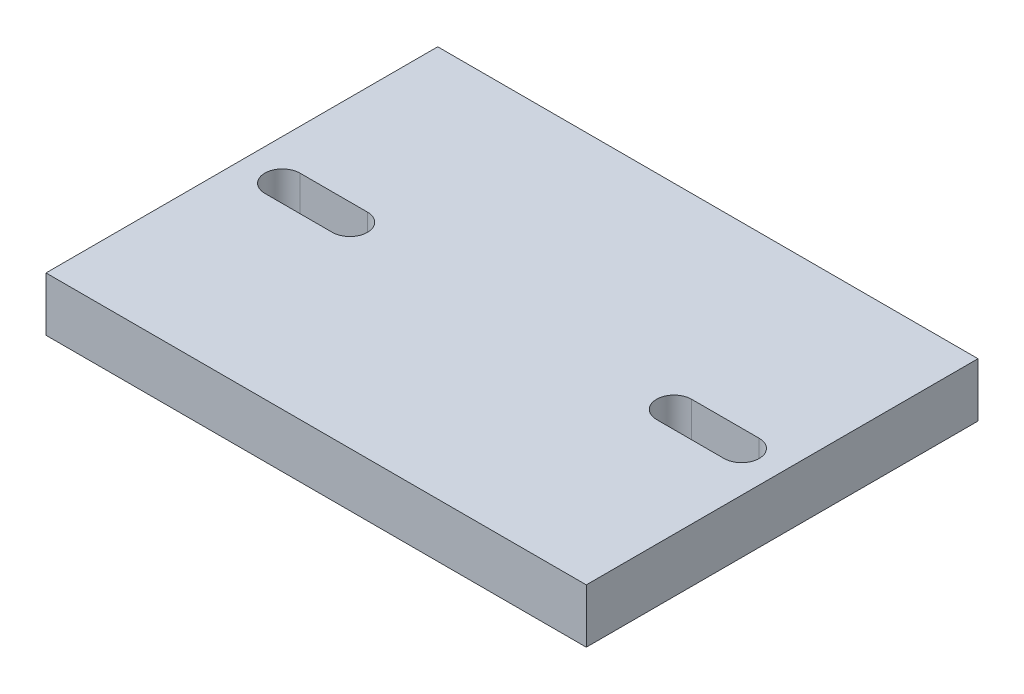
ISO-10303-21;
HEADER;
FILE_DESCRIPTION(('STEP AP214'),'2;1');
FILE_NAME('part.step','',(''),(''),'','','');
FILE_SCHEMA(('AUTOMOTIVE_DESIGN { 1 0 10303 214 1 1 1 1 }'));
ENDSEC;
DATA;
#1=APPLICATION_CONTEXT('core data for automotive mechanical design processes');
#2=APPLICATION_PROTOCOL_DEFINITION('international standard','automotive_design',2000,#1);
#3=PRODUCT_CONTEXT('',#1,'mechanical');
#4=PRODUCT('Part','Part','',(#3));
#5=PRODUCT_RELATED_PRODUCT_CATEGORY('part','',(#4));
#6=PRODUCT_DEFINITION_FORMATION('','',#4);
#7=PRODUCT_DEFINITION_CONTEXT('part definition',#1,'design');
#8=PRODUCT_DEFINITION('design','',#6,#7);
#9=PRODUCT_DEFINITION_SHAPE('','',#8);
#10=(LENGTH_UNIT() NAMED_UNIT(*) SI_UNIT(.MILLI.,.METRE.));
#11=(NAMED_UNIT(*) PLANE_ANGLE_UNIT() SI_UNIT($,.RADIAN.));
#12=(NAMED_UNIT(*) SI_UNIT($,.STERADIAN.) SOLID_ANGLE_UNIT());
#13=UNCERTAINTY_MEASURE_WITH_UNIT(LENGTH_MEASURE(1.E-05),#10,'distance_accuracy_value','');
#14=(GEOMETRIC_REPRESENTATION_CONTEXT(3) GLOBAL_UNCERTAINTY_ASSIGNED_CONTEXT((#13)) GLOBAL_UNIT_ASSIGNED_CONTEXT((#10,
#11,#12)) REPRESENTATION_CONTEXT('',''));
#15=CARTESIAN_POINT('',(0.,0.,0.));
#16=DIRECTION('',(0.,0.,1.));
#17=DIRECTION('',(1.,0.,0.));
#18=AXIS2_PLACEMENT_3D('',#15,#16,#17);
#19=CARTESIAN_POINT('',(-80.,0.,58.));
#20=DIRECTION('',(1.,0.,0.));
#21=DIRECTION('',(0.,0.,-1.));
#22=AXIS2_PLACEMENT_3D('',#19,#20,#21);
#23=PLANE('',#22);
#24=DIRECTION('',(0.,-1.,0.));
#25=VECTOR('',#24,1.);
#26=CARTESIAN_POINT('',(-80.,0.,0.));
#27=LINE('',#26,#25);
#28=CARTESIAN_POINT('',(-80.,8.,0.));
#29=VERTEX_POINT('',#28);
#30=CARTESIAN_POINT('',(-80.,0.,0.));
#31=VERTEX_POINT('',#30);
#32=EDGE_CURVE('E185',#29,#31,#27,.T.);
#33=ORIENTED_EDGE('',*,*,#32,.T.);
#34=DIRECTION('',(0.,0.,-1.));
#35=VECTOR('',#34,1.);
#36=CARTESIAN_POINT('',(-80.,0.,58.));
#37=LINE('',#36,#35);
#38=CARTESIAN_POINT('',(-80.,0.,58.));
#39=VERTEX_POINT('',#38);
#40=EDGE_CURVE('E11',#39,#31,#37,.T.);
#41=ORIENTED_EDGE('',*,*,#40,.F.);
#42=DIRECTION('',(0.,-1.,0.));
#43=VECTOR('',#42,1.);
#44=CARTESIAN_POINT('',(-80.,0.,58.));
#45=LINE('',#44,#43);
#46=CARTESIAN_POINT('',(-80.,8.,58.));
#47=VERTEX_POINT('',#46);
#48=EDGE_CURVE('E192',#47,#39,#45,.T.);
#49=ORIENTED_EDGE('',*,*,#48,.F.);
#50=DIRECTION('',(0.,0.,-1.));
#51=VECTOR('',#50,1.);
#52=CARTESIAN_POINT('',(-80.,8.,58.));
#53=LINE('',#52,#51);
#54=EDGE_CURVE('E202',#47,#29,#53,.T.);
#55=ORIENTED_EDGE('',*,*,#54,.T.);
#56=EDGE_LOOP('',(#33,#41,#49,#55));
#57=FACE_BOUND('',#56,.T.);
#58=ADVANCED_FACE('F35',(#57),#23,.F.);
#59=CARTESIAN_POINT('',(-80.,0.,58.));
#60=DIRECTION('',(0.,1.,0.));
#61=DIRECTION('',(0.,0.,1.));
#62=AXIS2_PLACEMENT_3D('',#59,#60,#61);
#63=PLANE('',#62);
#64=DIRECTION('',(-1.,0.,0.));
#65=VECTOR('',#64,1.);
#66=CARTESIAN_POINT('',(-6.,0.,26.4));
#67=LINE('',#66,#65);
#68=CARTESIAN_POINT('',(-6.,0.,26.4));
#69=VERTEX_POINT('',#68);
#70=CARTESIAN_POINT('',(-16.,0.,26.4));
#71=VERTEX_POINT('',#70);
#72=EDGE_CURVE('E131',#69,#71,#67,.T.);
#73=ORIENTED_EDGE('',*,*,#72,.T.);
#74=CARTESIAN_POINT('',(-16.,0.,29.));
#75=DIRECTION('',(0.,1.,0.));
#76=DIRECTION('',(0.,0.,1.));
#77=AXIS2_PLACEMENT_3D('',#74,#75,#76);
#78=CIRCLE('',#77,2.59999999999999);
#79=CARTESIAN_POINT('',(-16.,0.,31.6));
#80=VERTEX_POINT('',#79);
#81=EDGE_CURVE('E125',#71,#80,#78,.T.);
#82=ORIENTED_EDGE('',*,*,#81,.T.);
#83=DIRECTION('',(1.,0.,0.));
#84=VECTOR('',#83,1.);
#85=CARTESIAN_POINT('',(-6.,0.,31.6));
#86=LINE('',#85,#84);
#87=CARTESIAN_POINT('',(-6.00000000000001,0.,31.6));
#88=VERTEX_POINT('',#87);
#89=EDGE_CURVE('E134',#80,#88,#86,.T.);
#90=ORIENTED_EDGE('',*,*,#89,.T.);
#91=CARTESIAN_POINT('',(-6.,0.,29.));
#92=DIRECTION('',(0.,1.,0.));
#93=DIRECTION('',(0.,0.,-1.));
#94=AXIS2_PLACEMENT_3D('',#91,#92,#93);
#95=CIRCLE('',#94,2.59999999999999);
#96=EDGE_CURVE('E49',#88,#69,#95,.T.);
#97=ORIENTED_EDGE('',*,*,#96,.T.);
#98=EDGE_LOOP('',(#73,#82,#90,#97));
#99=FACE_BOUND('',#98,.T.);
#100=DIRECTION('',(-1.,0.,0.));
#101=VECTOR('',#100,1.);
#102=CARTESIAN_POINT('',(-74.,0.,26.4));
#103=LINE('',#102,#101);
#104=CARTESIAN_POINT('',(-64.,0.,26.4));
#105=VERTEX_POINT('',#104);
#106=CARTESIAN_POINT('',(-74.,0.,26.4));
#107=VERTEX_POINT('',#106);
#108=EDGE_CURVE('E170',#105,#107,#103,.T.);
#109=ORIENTED_EDGE('',*,*,#108,.T.);
#110=CARTESIAN_POINT('',(-74.,0.,29.));
#111=DIRECTION('',(0.,1.,0.));
#112=DIRECTION('',(0.,0.,1.));
#113=AXIS2_PLACEMENT_3D('',#110,#111,#112);
#114=CIRCLE('',#113,2.6);
#115=CARTESIAN_POINT('',(-74.,0.,31.6));
#116=VERTEX_POINT('',#115);
#117=EDGE_CURVE('E160',#107,#116,#114,.T.);
#118=ORIENTED_EDGE('',*,*,#117,.T.);
#119=DIRECTION('',(1.,0.,0.));
#120=VECTOR('',#119,1.);
#121=CARTESIAN_POINT('',(-74.,0.,31.6));
#122=LINE('',#121,#120);
#123=CARTESIAN_POINT('',(-64.,0.,31.6));
#124=VERTEX_POINT('',#123);
#125=EDGE_CURVE('E163',#116,#124,#122,.T.);
#126=ORIENTED_EDGE('',*,*,#125,.T.);
#127=CARTESIAN_POINT('',(-64.,0.,29.));
#128=DIRECTION('',(0.,1.,0.));
#129=DIRECTION('',(0.,0.,-1.));
#130=AXIS2_PLACEMENT_3D('',#127,#128,#129);
#131=CIRCLE('',#130,2.6);
#132=EDGE_CURVE('E167',#124,#105,#131,.T.);
#133=ORIENTED_EDGE('',*,*,#132,.T.);
#134=EDGE_LOOP('',(#109,#118,#126,#133));
#135=FACE_BOUND('',#134,.T.);
#136=DIRECTION('',(1.,0.,0.));
#137=VECTOR('',#136,1.);
#138=CARTESIAN_POINT('',(-80.,0.,0.));
#139=LINE('',#138,#137);
#140=CARTESIAN_POINT('',(0.,0.,0.));
#141=VERTEX_POINT('',#140);
#142=EDGE_CURVE('E205',#31,#141,#139,.T.);
#143=ORIENTED_EDGE('',*,*,#142,.T.);
#144=DIRECTION('',(0.,0.,-1.));
#145=VECTOR('',#144,1.);
#146=CARTESIAN_POINT('',(0.,0.,58.));
#147=LINE('',#146,#145);
#148=CARTESIAN_POINT('',(0.,0.,58.));
#149=VERTEX_POINT('',#148);
#150=EDGE_CURVE('E42',#149,#141,#147,.T.);
#151=ORIENTED_EDGE('',*,*,#150,.F.);
#152=DIRECTION('',(1.,0.,0.));
#153=VECTOR('',#152,1.);
#154=CARTESIAN_POINT('',(-80.,0.,58.));
#155=LINE('',#154,#153);
#156=EDGE_CURVE('E195',#39,#149,#155,.T.);
#157=ORIENTED_EDGE('',*,*,#156,.F.);
#158=ORIENTED_EDGE('',*,*,#40,.T.);
#159=EDGE_LOOP('',(#143,#151,#157,#158));
#160=FACE_BOUND('',#159,.T.);
#161=ADVANCED_FACE('F138',(#99,#135,#160),#63,.F.);
#162=CARTESIAN_POINT('',(0.,0.,58.));
#163=DIRECTION('',(-1.,0.,0.));
#164=DIRECTION('',(0.,0.,1.));
#165=AXIS2_PLACEMENT_3D('',#162,#163,#164);
#166=PLANE('',#165);
#167=DIRECTION('',(0.,1.,0.));
#168=VECTOR('',#167,1.);
#169=CARTESIAN_POINT('',(0.,0.,0.));
#170=LINE('',#169,#168);
#171=CARTESIAN_POINT('',(0.,8.,0.));
#172=VERTEX_POINT('',#171);
#173=EDGE_CURVE('E207',#141,#172,#170,.T.);
#174=ORIENTED_EDGE('',*,*,#173,.T.);
#175=DIRECTION('',(0.,0.,-1.));
#176=VECTOR('',#175,1.);
#177=CARTESIAN_POINT('',(0.,8.,58.));
#178=LINE('',#177,#176);
#179=CARTESIAN_POINT('',(0.,8.,58.));
#180=VERTEX_POINT('',#179);
#181=EDGE_CURVE('E212',#180,#172,#178,.T.);
#182=ORIENTED_EDGE('',*,*,#181,.F.);
#183=DIRECTION('',(0.,1.,0.));
#184=VECTOR('',#183,1.);
#185=CARTESIAN_POINT('',(0.,0.,58.));
#186=LINE('',#185,#184);
#187=EDGE_CURVE('E198',#149,#180,#186,.T.);
#188=ORIENTED_EDGE('',*,*,#187,.F.);
#189=ORIENTED_EDGE('',*,*,#150,.T.);
#190=EDGE_LOOP('',(#174,#182,#188,#189));
#191=FACE_BOUND('',#190,.T.);
#192=ADVANCED_FACE('F219',(#191),#166,.F.);
#193=CARTESIAN_POINT('',(-80.,8.,58.));
#194=DIRECTION('',(0.,-1.,0.));
#195=DIRECTION('',(0.,0.,-1.));
#196=AXIS2_PLACEMENT_3D('',#193,#194,#195);
#197=PLANE('',#196);
#198=DIRECTION('',(1.,0.,0.));
#199=VECTOR('',#198,1.);
#200=CARTESIAN_POINT('',(-6.,8.,31.6));
#201=LINE('',#200,#199);
#202=CARTESIAN_POINT('',(-16.,8.,31.6));
#203=VERTEX_POINT('',#202);
#204=CARTESIAN_POINT('',(-6.,8.,31.6));
#205=VERTEX_POINT('',#204);
#206=EDGE_CURVE('E150',#203,#205,#201,.T.);
#207=ORIENTED_EDGE('',*,*,#206,.F.);
#208=CARTESIAN_POINT('',(-16.,8.,29.));
#209=DIRECTION('',(0.,1.,0.));
#210=DIRECTION('',(0.,0.,1.));
#211=AXIS2_PLACEMENT_3D('',#208,#209,#210);
#212=CIRCLE('',#211,2.59999999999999);
#213=CARTESIAN_POINT('',(-16.,8.,26.4));
#214=VERTEX_POINT('',#213);
#215=EDGE_CURVE('E57',#214,#203,#212,.T.);
#216=ORIENTED_EDGE('',*,*,#215,.F.);
#217=DIRECTION('',(-1.,0.,0.));
#218=VECTOR('',#217,1.);
#219=CARTESIAN_POINT('',(-6.,8.,26.4));
#220=LINE('',#219,#218);
#221=CARTESIAN_POINT('',(-6.,8.,26.4));
#222=VERTEX_POINT('',#221);
#223=EDGE_CURVE('E141',#222,#214,#220,.T.);
#224=ORIENTED_EDGE('',*,*,#223,.F.);
#225=CARTESIAN_POINT('',(-6.,8.,29.));
#226=DIRECTION('',(0.,1.,0.));
#227=DIRECTION('',(0.,0.,-1.));
#228=AXIS2_PLACEMENT_3D('',#225,#226,#227);
#229=CIRCLE('',#228,2.59999999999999);
#230=EDGE_CURVE('E144',#205,#222,#229,.T.);
#231=ORIENTED_EDGE('',*,*,#230,.F.);
#232=EDGE_LOOP('',(#207,#216,#224,#231));
#233=FACE_BOUND('',#232,.T.);
#234=DIRECTION('',(1.,0.,0.));
#235=VECTOR('',#234,1.);
#236=CARTESIAN_POINT('',(-74.,8.,31.6));
#237=LINE('',#236,#235);
#238=CARTESIAN_POINT('',(-74.,8.,31.6));
#239=VERTEX_POINT('',#238);
#240=CARTESIAN_POINT('',(-64.,8.,31.6));
#241=VERTEX_POINT('',#240);
#242=EDGE_CURVE('E175',#239,#241,#237,.T.);
#243=ORIENTED_EDGE('',*,*,#242,.F.);
#244=CARTESIAN_POINT('',(-74.,8.,29.));
#245=DIRECTION('',(0.,1.,0.));
#246=DIRECTION('',(0.,0.,1.));
#247=AXIS2_PLACEMENT_3D('',#244,#245,#246);
#248=CIRCLE('',#247,2.6);
#249=CARTESIAN_POINT('',(-74.,8.,26.4));
#250=VERTEX_POINT('',#249);
#251=EDGE_CURVE('E156',#250,#239,#248,.T.);
#252=ORIENTED_EDGE('',*,*,#251,.F.);
#253=DIRECTION('',(-1.,0.,0.));
#254=VECTOR('',#253,1.);
#255=CARTESIAN_POINT('',(-74.,8.,26.4));
#256=LINE('',#255,#254);
#257=CARTESIAN_POINT('',(-64.,8.,26.4));
#258=VERTEX_POINT('',#257);
#259=EDGE_CURVE('E164',#258,#250,#256,.T.);
#260=ORIENTED_EDGE('',*,*,#259,.F.);
#261=CARTESIAN_POINT('',(-64.,8.,29.));
#262=DIRECTION('',(0.,1.,0.));
#263=DIRECTION('',(0.,0.,-1.));
#264=AXIS2_PLACEMENT_3D('',#261,#262,#263);
#265=CIRCLE('',#264,2.6);
#266=EDGE_CURVE('E178',#241,#258,#265,.T.);
#267=ORIENTED_EDGE('',*,*,#266,.F.);
#268=EDGE_LOOP('',(#243,#252,#260,#267));
#269=FACE_BOUND('',#268,.T.);
#270=DIRECTION('',(-1.,0.,0.));
#271=VECTOR('',#270,1.);
#272=CARTESIAN_POINT('',(-80.,8.,0.));
#273=LINE('',#272,#271);
#274=EDGE_CURVE('E196',#172,#29,#273,.T.);
#275=ORIENTED_EDGE('',*,*,#274,.T.);
#276=ORIENTED_EDGE('',*,*,#54,.F.);
#277=DIRECTION('',(-1.,0.,0.));
#278=VECTOR('',#277,1.);
#279=CARTESIAN_POINT('',(-80.,8.,58.));
#280=LINE('',#279,#278);
#281=EDGE_CURVE('E200',#180,#47,#280,.T.);
#282=ORIENTED_EDGE('',*,*,#281,.F.);
#283=ORIENTED_EDGE('',*,*,#181,.T.);
#284=EDGE_LOOP('',(#275,#276,#282,#283));
#285=FACE_BOUND('',#284,.T.);
#286=ADVANCED_FACE('F228',(#233,#269,#285),#197,.F.);
#287=CARTESIAN_POINT('',(0.,0.,58.));
#288=DIRECTION('',(0.,0.,-1.));
#289=DIRECTION('',(-1.,0.,0.));
#290=AXIS2_PLACEMENT_3D('',#287,#288,#289);
#291=PLANE('',#290);
#292=ORIENTED_EDGE('',*,*,#48,.T.);
#293=ORIENTED_EDGE('',*,*,#156,.T.);
#294=ORIENTED_EDGE('',*,*,#187,.T.);
#295=ORIENTED_EDGE('',*,*,#281,.T.);
#296=EDGE_LOOP('',(#292,#293,#294,#295));
#297=FACE_BOUND('',#296,.T.);
#298=ADVANCED_FACE('F234',(#297),#291,.F.);
#299=CARTESIAN_POINT('',(0.,0.,0.));
#300=DIRECTION('',(0.,0.,-1.));
#301=DIRECTION('',(-1.,0.,0.));
#302=AXIS2_PLACEMENT_3D('',#299,#300,#301);
#303=PLANE('',#302);
#304=ORIENTED_EDGE('',*,*,#32,.F.);
#305=ORIENTED_EDGE('',*,*,#274,.F.);
#306=ORIENTED_EDGE('',*,*,#173,.F.);
#307=ORIENTED_EDGE('',*,*,#142,.F.);
#308=EDGE_LOOP('',(#304,#305,#306,#307));
#309=FACE_BOUND('',#308,.T.);
#310=ADVANCED_FACE('F225',(#309),#303,.T.);
#311=CARTESIAN_POINT('',(-74.,0.,29.));
#312=DIRECTION('',(0.,1.,0.));
#313=DIRECTION('',(0.,0.,1.));
#314=AXIS2_PLACEMENT_3D('',#311,#312,#313);
#315=CYLINDRICAL_SURFACE('',#314,2.6);
#316=ORIENTED_EDGE('',*,*,#251,.T.);
#317=DIRECTION('',(0.,1.,0.));
#318=VECTOR('',#317,1.);
#319=CARTESIAN_POINT('',(-74.,0.,31.6));
#320=LINE('',#319,#318);
#321=EDGE_CURVE('E173',#116,#239,#320,.T.);
#322=ORIENTED_EDGE('',*,*,#321,.F.);
#323=ORIENTED_EDGE('',*,*,#117,.F.);
#324=DIRECTION('',(0.,1.,0.));
#325=VECTOR('',#324,1.);
#326=CARTESIAN_POINT('',(-74.,0.,26.4));
#327=LINE('',#326,#325);
#328=EDGE_CURVE('E183',#107,#250,#327,.T.);
#329=ORIENTED_EDGE('',*,*,#328,.T.);
#330=EDGE_LOOP('',(#316,#322,#323,#329));
#331=FACE_BOUND('',#330,.T.);
#332=ADVANCED_FACE('F247',(#331),#315,.F.);
#333=CARTESIAN_POINT('',(-74.,0.,26.4));
#334=DIRECTION('',(0.,0.,-1.));
#335=DIRECTION('',(-1.,0.,0.));
#336=AXIS2_PLACEMENT_3D('',#333,#334,#335);
#337=PLANE('',#336);
#338=ORIENTED_EDGE('',*,*,#259,.T.);
#339=ORIENTED_EDGE('',*,*,#328,.F.);
#340=ORIENTED_EDGE('',*,*,#108,.F.);
#341=DIRECTION('',(0.,1.,0.));
#342=VECTOR('',#341,1.);
#343=CARTESIAN_POINT('',(-64.,0.,26.4));
#344=LINE('',#343,#342);
#345=EDGE_CURVE('E186',#105,#258,#344,.T.);
#346=ORIENTED_EDGE('',*,*,#345,.T.);
#347=EDGE_LOOP('',(#338,#339,#340,#346));
#348=FACE_BOUND('',#347,.T.);
#349=ADVANCED_FACE('F252',(#348),#337,.F.);
#350=CARTESIAN_POINT('',(-64.,0.,29.));
#351=DIRECTION('',(0.,1.,0.));
#352=DIRECTION('',(0.,0.,1.));
#353=AXIS2_PLACEMENT_3D('',#350,#351,#352);
#354=CYLINDRICAL_SURFACE('',#353,2.6);
#355=ORIENTED_EDGE('',*,*,#266,.T.);
#356=ORIENTED_EDGE('',*,*,#345,.F.);
#357=ORIENTED_EDGE('',*,*,#132,.F.);
#358=DIRECTION('',(0.,1.,0.));
#359=VECTOR('',#358,1.);
#360=CARTESIAN_POINT('',(-64.,0.,31.6));
#361=LINE('',#360,#359);
#362=EDGE_CURVE('E188',#124,#241,#361,.T.);
#363=ORIENTED_EDGE('',*,*,#362,.T.);
#364=EDGE_LOOP('',(#355,#356,#357,#363));
#365=FACE_BOUND('',#364,.T.);
#366=ADVANCED_FACE('F257',(#365),#354,.F.);
#367=CARTESIAN_POINT('',(-74.,0.,31.6));
#368=DIRECTION('',(0.,0.,1.));
#369=DIRECTION('',(1.,0.,0.));
#370=AXIS2_PLACEMENT_3D('',#367,#368,#369);
#371=PLANE('',#370);
#372=ORIENTED_EDGE('',*,*,#242,.T.);
#373=ORIENTED_EDGE('',*,*,#362,.F.);
#374=ORIENTED_EDGE('',*,*,#125,.F.);
#375=ORIENTED_EDGE('',*,*,#321,.T.);
#376=EDGE_LOOP('',(#372,#373,#374,#375));
#377=FACE_BOUND('',#376,.T.);
#378=ADVANCED_FACE('F254',(#377),#371,.F.);
#379=CARTESIAN_POINT('',(-16.,0.,29.));
#380=DIRECTION('',(0.,1.,0.));
#381=DIRECTION('',(0.,0.,1.));
#382=AXIS2_PLACEMENT_3D('',#379,#380,#381);
#383=CYLINDRICAL_SURFACE('',#382,2.59999999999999);
#384=ORIENTED_EDGE('',*,*,#215,.T.);
#385=DIRECTION('',(0.,1.,0.));
#386=VECTOR('',#385,1.);
#387=CARTESIAN_POINT('',(-16.,0.,31.6));
#388=LINE('',#387,#386);
#389=EDGE_CURVE('E121',#80,#203,#388,.T.);
#390=ORIENTED_EDGE('',*,*,#389,.F.);
#391=ORIENTED_EDGE('',*,*,#81,.F.);
#392=DIRECTION('',(0.,1.,0.));
#393=VECTOR('',#392,1.);
#394=CARTESIAN_POINT('',(-16.,0.,26.4));
#395=LINE('',#394,#393);
#396=EDGE_CURVE('E154',#71,#214,#395,.T.);
#397=ORIENTED_EDGE('',*,*,#396,.T.);
#398=EDGE_LOOP('',(#384,#390,#391,#397));
#399=FACE_BOUND('',#398,.T.);
#400=ADVANCED_FACE('F123',(#399),#383,.F.);
#401=CARTESIAN_POINT('',(-6.,0.,26.4));
#402=DIRECTION('',(0.,0.,-1.));
#403=DIRECTION('',(-1.,0.,0.));
#404=AXIS2_PLACEMENT_3D('',#401,#402,#403);
#405=PLANE('',#404);
#406=ORIENTED_EDGE('',*,*,#223,.T.);
#407=ORIENTED_EDGE('',*,*,#396,.F.);
#408=ORIENTED_EDGE('',*,*,#72,.F.);
#409=DIRECTION('',(0.,1.,0.));
#410=VECTOR('',#409,1.);
#411=CARTESIAN_POINT('',(-6.,0.,26.4));
#412=LINE('',#411,#410);
#413=EDGE_CURVE('E157',#69,#222,#412,.T.);
#414=ORIENTED_EDGE('',*,*,#413,.T.);
#415=EDGE_LOOP('',(#406,#407,#408,#414));
#416=FACE_BOUND('',#415,.T.);
#417=ADVANCED_FACE('F267',(#416),#405,.F.);
#418=CARTESIAN_POINT('',(-6.,0.,29.));
#419=DIRECTION('',(0.,1.,0.));
#420=DIRECTION('',(0.,0.,1.));
#421=AXIS2_PLACEMENT_3D('',#418,#419,#420);
#422=CYLINDRICAL_SURFACE('',#421,2.59999999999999);
#423=ORIENTED_EDGE('',*,*,#230,.T.);
#424=ORIENTED_EDGE('',*,*,#413,.F.);
#425=ORIENTED_EDGE('',*,*,#96,.F.);
#426=DIRECTION('',(0.,1.,0.));
#427=VECTOR('',#426,1.);
#428=CARTESIAN_POINT('',(-6.,0.,31.6));
#429=LINE('',#428,#427);
#430=EDGE_CURVE('E130',#88,#205,#429,.T.);
#431=ORIENTED_EDGE('',*,*,#430,.T.);
#432=EDGE_LOOP('',(#423,#424,#425,#431));
#433=FACE_BOUND('',#432,.T.);
#434=ADVANCED_FACE('F270',(#433),#422,.F.);
#435=CARTESIAN_POINT('',(-6.,0.,31.6));
#436=DIRECTION('',(0.,0.,1.));
#437=DIRECTION('',(1.,0.,0.));
#438=AXIS2_PLACEMENT_3D('',#435,#436,#437);
#439=PLANE('',#438);
#440=ORIENTED_EDGE('',*,*,#206,.T.);
#441=ORIENTED_EDGE('',*,*,#430,.F.);
#442=ORIENTED_EDGE('',*,*,#89,.F.);
#443=ORIENTED_EDGE('',*,*,#389,.T.);
#444=EDGE_LOOP('',(#440,#441,#442,#443));
#445=FACE_BOUND('',#444,.T.);
#446=ADVANCED_FACE('F135',(#445),#439,.F.);
#447=CLOSED_SHELL('',(#58,#161,#192,#286,#298,#310,#332,#349,#366,#378,#400,#417,#434,#446));
#448=MANIFOLD_SOLID_BREP('B2',#447);
#449=ADVANCED_BREP_SHAPE_REPRESENTATION('',(#18,#448),#14);
#450=SHAPE_DEFINITION_REPRESENTATION(#9,#449);
ENDSEC;
END-ISO-10303-21;
